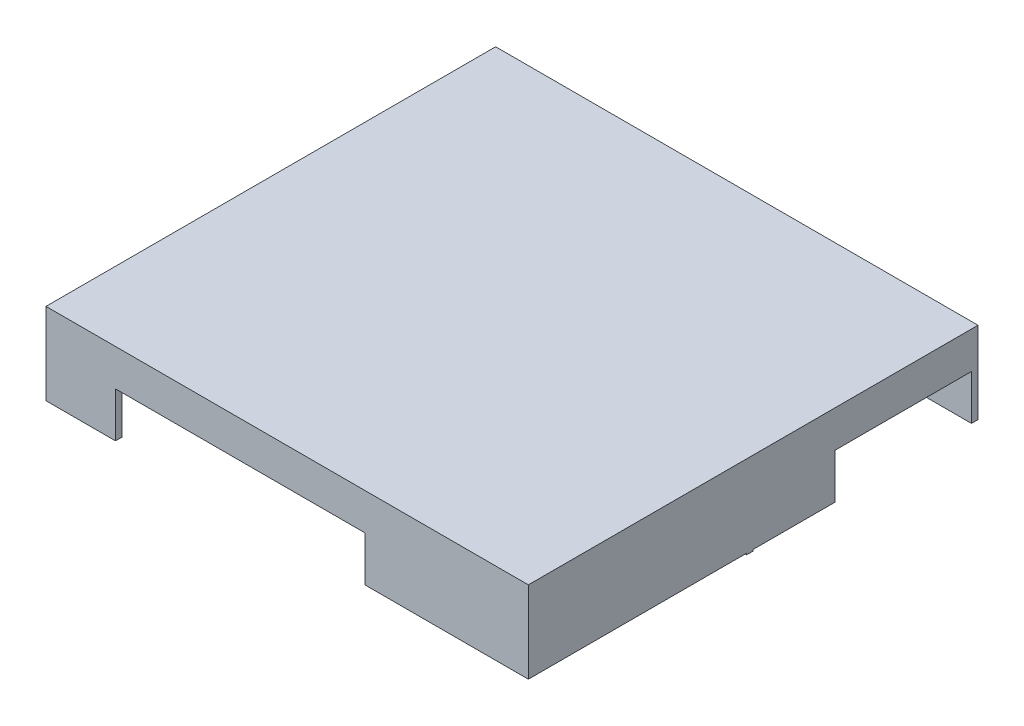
from build123d import *

# Parameters (mm, degrees)
SKETCH1_W           = 14.986
SKETCH1_H           = 13.97
BOSS_EXTRUDE1_DEPTH = 2.54
SHELL1_T            = -0.2032
SKETCH2_W           = 0.2032
SKETCH2_H           = 0.2032
BOSS_EXTRUDE2_DEPTH = 0.045
CUT_EXTRUDE1_REACH  = 18.728
SKETCH3_W           = 4.2418
SKETCH3_H           = 1.397
CUT_EXTRUDE2_REACH  = 18.055
SKETCH4_W           = 6.2484
SKETCH4_H           = 1.4
CUT_EXTRUDE4_START  = -0.2032
SKETCH5_W           = 6.6326
SKETCH5_H           = 1.4
CUT_EXTRUDE4_DEPTH  = 0.2032
CUT_EXTRUDE5_REACH  = 18.055
SKETCH6_W           = 7.747
SKETCH6_H           = 1.4


with BuildPart() as part:
    # Sketch1 → Boss-Extrude1 (new body)
    with BuildSketch(Plane(origin=(0, 0, 0), x_dir=(1, 0, 0), z_dir=(0, 1, 0))):
        Rectangle(SKETCH1_W, SKETCH1_H)
    extrude(amount=BOSS_EXTRUDE1_DEPTH)

    # Shell1
    shell1_openings = [part.faces().sort_by_distance(p)[0] for p in [
        (0, 0, 0),
    ]]
    offset(amount=SHELL1_T, openings=shell1_openings, kind=Kind.INTERSECTION)

    # Sketch2 → Boss-Extrude2 (add)
    with BuildSketch(Plane(origin=(0, 0, 0), x_dir=(-1, 0, 0), z_dir=(0, -1, 0))):
        with Locations((7.3914, -0.1016)):
            Rectangle(SKETCH2_W, SKETCH2_H)
        with Locations((-7.3914, -0.1016)):
            Rectangle(SKETCH2_W, SKETCH2_H)
        with Locations((0.1016, 6.8834)):
            Rectangle(SKETCH2_W, SKETCH2_H)
    extrude(amount=BOSS_EXTRUDE2_DEPTH)

    # Sketch3 → Cut-Extrude1 (cut, up to next)
    with BuildSketch(Plane(origin=(7.493, 0, 0), x_dir=(0, 0, -1), z_dir=(1, 0, 0)), mode=Mode.PRIVATE) as cut_extrude1_sk1:
        with Locations((4.6609, 0.6985)):
            Rectangle(SKETCH3_W, SKETCH3_H)
    cut_extrude1_tool1 = extrude(cut_extrude1_sk1.sketch, amount=-CUT_EXTRUDE1_REACH, mode=Mode.PRIVATE) & part.part
    add(cut_extrude1_tool1.solids().sort_by_distance((7.493, 0.6985, -4.6609))[0], mode=Mode.SUBTRACT)

    # Sketch4 → Cut-Extrude2 (cut, up to next)
    with BuildSketch(Plane(origin=(0, 0, -6.985), x_dir=(-1, 0, 0), z_dir=(0, 0, -1)), mode=Mode.PRIVATE) as cut_extrude2_sk1:
        with Locations((4.1656, 0.7)):
            Rectangle(SKETCH4_W, SKETCH4_H)
    cut_extrude2_tool1 = extrude(cut_extrude2_sk1.sketch, amount=-CUT_EXTRUDE2_REACH, mode=Mode.PRIVATE) & part.part
    add(cut_extrude2_tool1.solids().sort_by_distance((-4.1656, 0.7, -6.985))[0], mode=Mode.SUBTRACT)

    # Sketch5 → Cut-Extrude4 (cut)
    with BuildSketch(Plane.ZY.offset(7.493).offset(CUT_EXTRUDE4_START)):
        with Locations((3.4687, 0.7)):
            Rectangle(SKETCH5_W, SKETCH5_H)
    extrude(amount=CUT_EXTRUDE4_DEPTH, mode=Mode.SUBTRACT)

    # Sketch6 → Cut-Extrude5 (cut, up to next)
    with BuildSketch(Plane.XY.offset(6.985), mode=Mode.PRIVATE) as cut_extrude5_sk1:
        with Locations((-1.4605, 0.7)):
            Rectangle(SKETCH6_W, SKETCH6_H)
    cut_extrude5_tool1 = extrude(cut_extrude5_sk1.sketch, amount=-CUT_EXTRUDE5_REACH, mode=Mode.PRIVATE) & part.part
    add(cut_extrude5_tool1.solids().sort_by_distance((-1.4605, 0.7, 6.985))[0], mode=Mode.SUBTRACT)


solid = part.part
